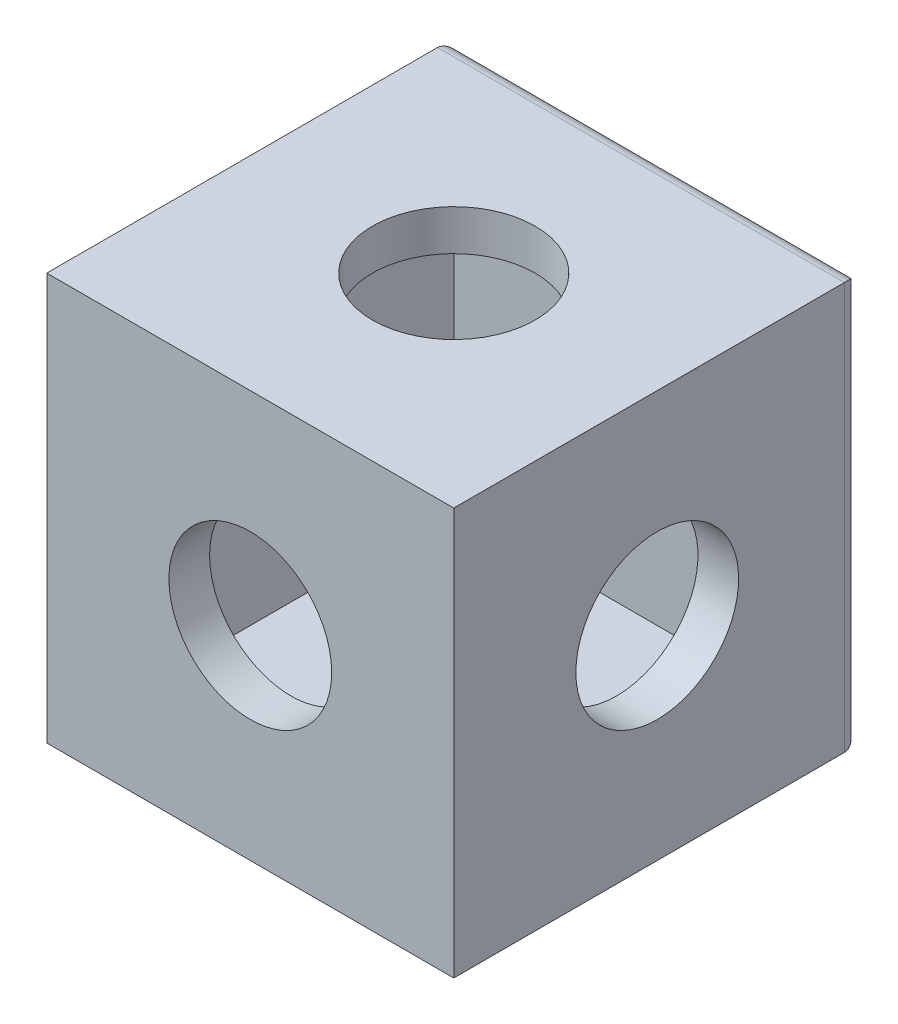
from build123d import *

# Parameters (mm, degrees)
CROQUIS1_W              = 125
CROQUIS1_H              = 125
CROQUIS1_W_2            = 100
CROQUIS1_H_2            = 100
SALIENTE_EXTRUIR1_DEPTH = 125
CROQUIS2_W              = 100
CROQUIS2_H              = 100
SALIENTE_EXTRUIR2_DEPTH = 12.5
CROQUIS3_R              = 25
CORTAR_EXTRUIR1_DEPTH   = 187.5
CROQUIS4_R              = 25
CORTAR_EXTRUIR2_DEPTH   = 187.5
CROQUIS6_W              = 100
CROQUIS6_H              = 100
SALIENTE_EXTRUIR3_DEPTH = 12.5
CROQUIS7_R              = 25
CORTAR_EXTRUIR3_DEPTH   = 39.5
REDONDEO1_R             = 5


with BuildPart() as part:
    # Croquis1 → Saliente-Extruir1 (new body)
    with BuildSketch(Plane.XY):
        Rectangle(CROQUIS1_W, CROQUIS1_H)
        Rectangle(CROQUIS1_W_2, CROQUIS1_H_2, mode=Mode.SUBTRACT)
    extrude(amount=SALIENTE_EXTRUIR1_DEPTH)

    # Croquis2 → Saliente-Extruir2 (add)
    with BuildSketch(Plane(origin=(0, 0, 0), x_dir=(-1, 0, 0), z_dir=(0, 0, -1))):
        Rectangle(CROQUIS2_W, CROQUIS2_H)
    extrude(amount=-SALIENTE_EXTRUIR2_DEPTH)

    # Croquis3 → Cortar-Extruir1 (cut)
    with BuildSketch(Plane.ZY.offset(62.5)):
        with Locations(Location((62.5, 0, 0), (0, 0, 270))):
            Circle(CROQUIS3_R)
    extrude(amount=-CORTAR_EXTRUIR1_DEPTH, mode=Mode.SUBTRACT)

    # Croquis4 → Cortar-Extruir2 (cut)
    with BuildSketch(Plane(origin=(0, 62.5, 0), x_dir=(1, 0, 0), z_dir=(0, 1, 0))):
        with Locations(Location((0, -62.5, 0), (0, 0, 270))):
            Circle(CROQUIS4_R)
    extrude(amount=-CORTAR_EXTRUIR2_DEPTH, mode=Mode.SUBTRACT)

    # Croquis6 → Saliente-Extruir3 (add)
    with BuildSketch(Plane.XY.offset(125)):
        Rectangle(CROQUIS6_W, CROQUIS6_H)
    extrude(amount=-SALIENTE_EXTRUIR3_DEPTH)

    # Croquis7 → Cortar-Extruir3 (cut)
    with BuildSketch(Plane.XY.offset(125)):
        Circle(CROQUIS7_R)
    extrude(amount=-CORTAR_EXTRUIR3_DEPTH, mode=Mode.SUBTRACT)

    # Redondeo1
    redondeo1_edges = [part.edges().sort_by_distance(p)[0] for p in [
        (0, -62.5, 0),
        (-62.5, 0, 0),
        (0, 62.5, 0),
        (62.5, 0, 0),
    ]]
    fillet(redondeo1_edges, radius=REDONDEO1_R)


solid = part.part
